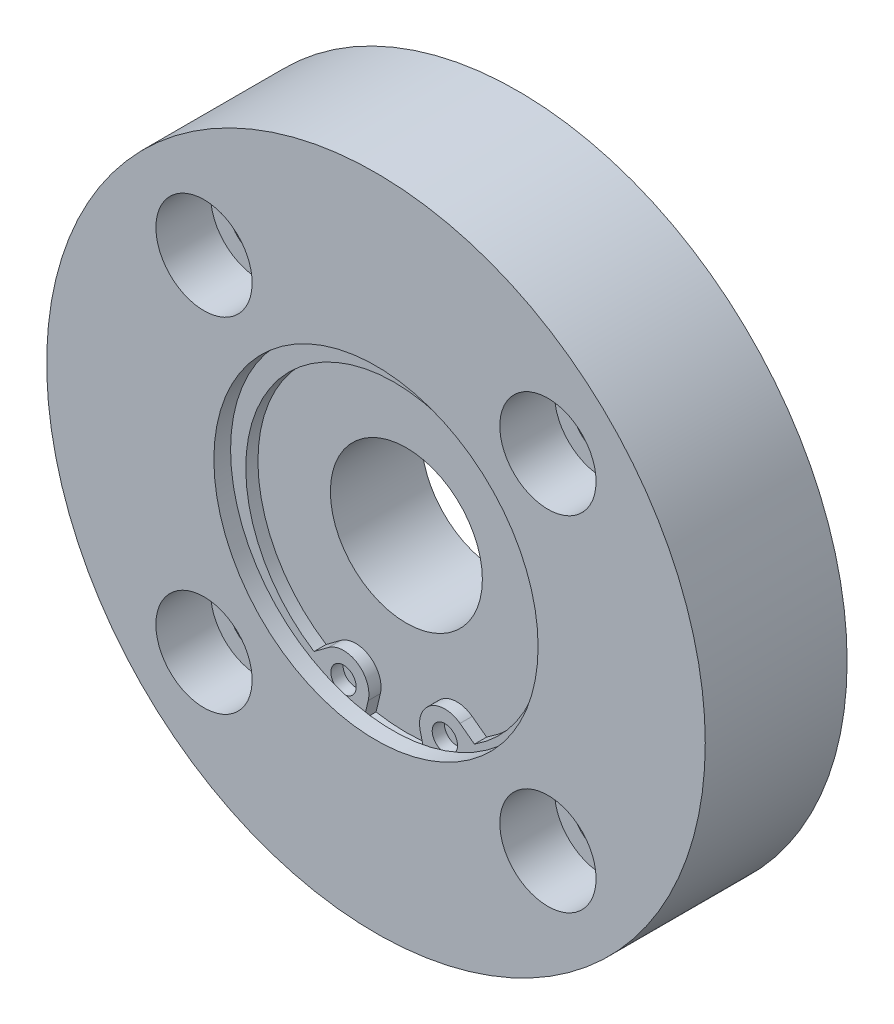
ISO-10303-21;
HEADER;
FILE_DESCRIPTION(('STEP AP214'),'2;1');
FILE_NAME('part.step','',(''),(''),'','','');
FILE_SCHEMA(('AUTOMOTIVE_DESIGN { 1 0 10303 214 1 1 1 1 }'));
ENDSEC;
DATA;
#1=APPLICATION_CONTEXT('core data for automotive mechanical design processes');
#2=APPLICATION_PROTOCOL_DEFINITION('international standard','automotive_design',2000,#1);
#3=PRODUCT_CONTEXT('',#1,'mechanical');
#4=PRODUCT('Part','Part','',(#3));
#5=PRODUCT_RELATED_PRODUCT_CATEGORY('part','',(#4));
#6=PRODUCT_DEFINITION_FORMATION('','',#4);
#7=PRODUCT_DEFINITION_CONTEXT('part definition',#1,'design');
#8=PRODUCT_DEFINITION('design','',#6,#7);
#9=PRODUCT_DEFINITION_SHAPE('','',#8);
#10=(LENGTH_UNIT() NAMED_UNIT(*) SI_UNIT(.MILLI.,.METRE.));
#11=(NAMED_UNIT(*) PLANE_ANGLE_UNIT() SI_UNIT($,.RADIAN.));
#12=(NAMED_UNIT(*) SI_UNIT($,.STERADIAN.) SOLID_ANGLE_UNIT());
#13=UNCERTAINTY_MEASURE_WITH_UNIT(LENGTH_MEASURE(1.E-05),#10,'distance_accuracy_value','');
#14=(GEOMETRIC_REPRESENTATION_CONTEXT(3) GLOBAL_UNCERTAINTY_ASSIGNED_CONTEXT((#13)) GLOBAL_UNIT_ASSIGNED_CONTEXT((#10,
#11,#12)) REPRESENTATION_CONTEXT('',''));
#15=CARTESIAN_POINT('',(0.,0.,0.));
#16=DIRECTION('',(0.,0.,1.));
#17=DIRECTION('',(1.,0.,0.));
#18=AXIS2_PLACEMENT_3D('',#15,#16,#17);
#19=CARTESIAN_POINT('',(0.,0.,11.));
#20=DIRECTION('',(0.,0.,1.));
#21=DIRECTION('',(1.,0.,0.));
#22=AXIS2_PLACEMENT_3D('',#19,#20,#21);
#23=PLANE('',#22);
#24=CARTESIAN_POINT('',(5.,-14.2233767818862,11.));
#25=DIRECTION('',(0.,0.,1.));
#26=DIRECTION('',(1.,0.,0.));
#27=AXIS2_PLACEMENT_3D('',#24,#25,#26);
#28=CIRCLE('',#27,1.25);
#29=CARTESIAN_POINT('',(6.25,-14.2233767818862,11.));
#30=VERTEX_POINT('',#29);
#31=EDGE_CURVE('E117',#30,#30,#28,.T.);
#32=ORIENTED_EDGE('',*,*,#31,.T.);
#33=EDGE_LOOP('',(#32));
#34=FACE_BOUND('',#33,.T.);
#35=ADVANCED_FACE('F14',(#34),#23,.T.);
#36=CARTESIAN_POINT('',(-5.,-14.2233767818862,11.));
#37=DIRECTION('',(0.,0.,-1.));
#38=DIRECTION('',(1.,0.,0.));
#39=AXIS2_PLACEMENT_3D('',#36,#37,#38);
#40=CIRCLE('',#39,1.25);
#41=CARTESIAN_POINT('',(-3.75,-14.2233767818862,11.));
#42=VERTEX_POINT('',#41);
#43=EDGE_CURVE('E143',#42,#42,#40,.T.);
#44=ORIENTED_EDGE('',*,*,#43,.F.);
#45=EDGE_LOOP('',(#44));
#46=FACE_BOUND('',#45,.T.);
#47=ADVANCED_FACE('F279',(#46),#23,.T.);
#48=CARTESIAN_POINT('',(16.9705627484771,16.9705627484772,8.6));
#49=DIRECTION('',(0.,0.,1.));
#50=DIRECTION('',(1.,0.,0.));
#51=AXIS2_PLACEMENT_3D('',#48,#49,#50);
#52=PLANE('',#51);
#53=CARTESIAN_POINT('',(16.9705627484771,16.9705627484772,8.6));
#54=DIRECTION('',(0.,0.,1.));
#55=DIRECTION('',(1.,0.,0.));
#56=AXIS2_PLACEMENT_3D('',#53,#54,#55);
#57=CIRCLE('',#56,4.75);
#58=CARTESIAN_POINT('',(21.7205627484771,16.9705627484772,8.6));
#59=VERTEX_POINT('',#58);
#60=EDGE_CURVE('E230',#59,#59,#57,.T.);
#61=ORIENTED_EDGE('',*,*,#60,.T.);
#62=EDGE_LOOP('',(#61));
#63=FACE_BOUND('',#62,.T.);
#64=CARTESIAN_POINT('',(16.9705627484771,16.9705627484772,8.6));
#65=DIRECTION('',(0.,0.,1.));
#66=DIRECTION('',(1.,0.,0.));
#67=AXIS2_PLACEMENT_3D('',#64,#65,#66);
#68=CIRCLE('',#67,3.);
#69=CARTESIAN_POINT('',(19.970562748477,16.9705627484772,8.6));
#70=VERTEX_POINT('',#69);
#71=EDGE_CURVE('E233',#70,#70,#68,.F.);
#72=ORIENTED_EDGE('',*,*,#71,.T.);
#73=EDGE_LOOP('',(#72));
#74=FACE_BOUND('',#73,.T.);
#75=ADVANCED_FACE('F287',(#63,#74),#52,.T.);
#76=CARTESIAN_POINT('',(16.9705627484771,-16.9705627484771,8.6));
#77=DIRECTION('',(0.,0.,1.));
#78=DIRECTION('',(0.,-1.,0.));
#79=AXIS2_PLACEMENT_3D('',#76,#77,#78);
#80=PLANE('',#79);
#81=CARTESIAN_POINT('',(16.9705627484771,-16.9705627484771,8.6));
#82=DIRECTION('',(0.,0.,1.));
#83=DIRECTION('',(0.,-1.,0.));
#84=AXIS2_PLACEMENT_3D('',#81,#82,#83);
#85=CIRCLE('',#84,4.75);
#86=CARTESIAN_POINT('',(16.9705627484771,-21.7205627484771,8.6));
#87=VERTEX_POINT('',#86);
#88=EDGE_CURVE('E214',#87,#87,#85,.T.);
#89=ORIENTED_EDGE('',*,*,#88,.T.);
#90=EDGE_LOOP('',(#89));
#91=FACE_BOUND('',#90,.T.);
#92=CARTESIAN_POINT('',(16.9705627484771,-16.9705627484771,8.6));
#93=DIRECTION('',(0.,0.,1.));
#94=DIRECTION('',(1.,0.,0.));
#95=AXIS2_PLACEMENT_3D('',#92,#93,#94);
#96=CIRCLE('',#95,3.);
#97=CARTESIAN_POINT('',(19.9705627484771,-16.9705627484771,8.6));
#98=VERTEX_POINT('',#97);
#99=EDGE_CURVE('E217',#98,#98,#96,.F.);
#100=ORIENTED_EDGE('',*,*,#99,.T.);
#101=EDGE_LOOP('',(#100));
#102=FACE_BOUND('',#101,.T.);
#103=ADVANCED_FACE('F583',(#91,#102),#80,.T.);
#104=CARTESIAN_POINT('',(-16.9705627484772,-16.9705627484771,8.6));
#105=DIRECTION('',(0.,0.,1.));
#106=DIRECTION('',(-1.,0.,0.));
#107=AXIS2_PLACEMENT_3D('',#104,#105,#106);
#108=PLANE('',#107);
#109=CARTESIAN_POINT('',(-16.9705627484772,-16.9705627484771,8.6));
#110=DIRECTION('',(0.,0.,1.));
#111=DIRECTION('',(-1.,0.,0.));
#112=AXIS2_PLACEMENT_3D('',#109,#110,#111);
#113=CIRCLE('',#112,4.75);
#114=CARTESIAN_POINT('',(-21.7205627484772,-16.9705627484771,8.6));
#115=VERTEX_POINT('',#114);
#116=EDGE_CURVE('E207',#115,#115,#113,.T.);
#117=ORIENTED_EDGE('',*,*,#116,.T.);
#118=EDGE_LOOP('',(#117));
#119=FACE_BOUND('',#118,.T.);
#120=CARTESIAN_POINT('',(-16.9705627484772,-16.9705627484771,8.6));
#121=DIRECTION('',(0.,0.,1.));
#122=DIRECTION('',(1.,0.,0.));
#123=AXIS2_PLACEMENT_3D('',#120,#121,#122);
#124=CIRCLE('',#123,3.);
#125=CARTESIAN_POINT('',(-13.9705627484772,-16.9705627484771,8.6));
#126=VERTEX_POINT('',#125);
#127=EDGE_CURVE('E210',#126,#126,#124,.F.);
#128=ORIENTED_EDGE('',*,*,#127,.T.);
#129=EDGE_LOOP('',(#128));
#130=FACE_BOUND('',#129,.T.);
#131=ADVANCED_FACE('F573',(#119,#130),#108,.T.);
#132=CARTESIAN_POINT('',(-16.9705627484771,16.9705627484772,8.6));
#133=DIRECTION('',(0.,0.,1.));
#134=DIRECTION('',(0.,1.,0.));
#135=AXIS2_PLACEMENT_3D('',#132,#133,#134);
#136=PLANE('',#135);
#137=CARTESIAN_POINT('',(-16.9705627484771,16.9705627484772,8.6));
#138=DIRECTION('',(0.,0.,1.));
#139=DIRECTION('',(0.,1.,0.));
#140=AXIS2_PLACEMENT_3D('',#137,#138,#139);
#141=CIRCLE('',#140,4.75);
#142=CARTESIAN_POINT('',(-16.970562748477,21.7205627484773,8.6));
#143=VERTEX_POINT('',#142);
#144=EDGE_CURVE('E200',#143,#143,#141,.T.);
#145=ORIENTED_EDGE('',*,*,#144,.T.);
#146=EDGE_LOOP('',(#145));
#147=FACE_BOUND('',#146,.T.);
#148=CARTESIAN_POINT('',(-16.9705627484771,16.9705627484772,8.6));
#149=DIRECTION('',(0.,0.,1.));
#150=DIRECTION('',(1.,0.,0.));
#151=AXIS2_PLACEMENT_3D('',#148,#149,#150);
#152=CIRCLE('',#151,3.);
#153=CARTESIAN_POINT('',(-13.9705627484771,16.9705627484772,8.6));
#154=VERTEX_POINT('',#153);
#155=EDGE_CURVE('E203',#154,#154,#152,.F.);
#156=ORIENTED_EDGE('',*,*,#155,.T.);
#157=EDGE_LOOP('',(#156));
#158=FACE_BOUND('',#157,.T.);
#159=ADVANCED_FACE('F563',(#147,#158),#136,.T.);
#160=CARTESIAN_POINT('',(16.9705627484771,16.9705627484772,0.));
#161=DIRECTION('',(0.,0.,1.));
#162=DIRECTION('',(1.,0.,0.));
#163=AXIS2_PLACEMENT_3D('',#160,#161,#162);
#164=CYLINDRICAL_SURFACE('',#163,3.);
#165=CARTESIAN_POINT('',(16.9705627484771,16.9705627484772,0.));
#166=DIRECTION('',(0.,0.,1.));
#167=DIRECTION('',(1.,0.,0.));
#168=AXIS2_PLACEMENT_3D('',#165,#166,#167);
#169=CIRCLE('',#168,3.);
#170=CARTESIAN_POINT('',(19.970562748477,16.9705627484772,0.));
#171=VERTEX_POINT('',#170);
#172=EDGE_CURVE('E234',#171,#171,#169,.T.);
#173=ORIENTED_EDGE('',*,*,#172,.F.);
#174=EDGE_LOOP('',(#173));
#175=FACE_BOUND('',#174,.T.);
#176=ORIENTED_EDGE('',*,*,#71,.F.);
#177=EDGE_LOOP('',(#176));
#178=FACE_BOUND('',#177,.T.);
#179=ADVANCED_FACE('F553',(#175,#178),#164,.F.);
#180=CARTESIAN_POINT('',(16.9705627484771,-16.9705627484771,0.));
#181=DIRECTION('',(0.,0.,1.));
#182=DIRECTION('',(1.,0.,0.));
#183=AXIS2_PLACEMENT_3D('',#180,#181,#182);
#184=CYLINDRICAL_SURFACE('',#183,3.);
#185=CARTESIAN_POINT('',(16.9705627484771,-16.9705627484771,0.));
#186=DIRECTION('',(0.,0.,1.));
#187=DIRECTION('',(0.,-1.,0.));
#188=AXIS2_PLACEMENT_3D('',#185,#186,#187);
#189=CIRCLE('',#188,3.);
#190=CARTESIAN_POINT('',(16.9705627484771,-19.9705627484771,0.));
#191=VERTEX_POINT('',#190);
#192=EDGE_CURVE('E224',#191,#191,#189,.T.);
#193=ORIENTED_EDGE('',*,*,#192,.F.);
#194=EDGE_LOOP('',(#193));
#195=FACE_BOUND('',#194,.T.);
#196=ORIENTED_EDGE('',*,*,#99,.F.);
#197=EDGE_LOOP('',(#196));
#198=FACE_BOUND('',#197,.T.);
#199=ADVANCED_FACE('F543',(#195,#198),#184,.F.);
#200=CARTESIAN_POINT('',(-16.9705627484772,-16.9705627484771,0.));
#201=DIRECTION('',(0.,0.,1.));
#202=DIRECTION('',(1.,0.,0.));
#203=AXIS2_PLACEMENT_3D('',#200,#201,#202);
#204=CYLINDRICAL_SURFACE('',#203,3.);
#205=CARTESIAN_POINT('',(-16.9705627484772,-16.9705627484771,0.));
#206=DIRECTION('',(0.,0.,1.));
#207=DIRECTION('',(-1.,0.,0.));
#208=AXIS2_PLACEMENT_3D('',#205,#206,#207);
#209=CIRCLE('',#208,3.);
#210=CARTESIAN_POINT('',(-19.9705627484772,-16.9705627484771,0.));
#211=VERTEX_POINT('',#210);
#212=EDGE_CURVE('E221',#211,#211,#209,.T.);
#213=ORIENTED_EDGE('',*,*,#212,.F.);
#214=EDGE_LOOP('',(#213));
#215=FACE_BOUND('',#214,.T.);
#216=ORIENTED_EDGE('',*,*,#127,.F.);
#217=EDGE_LOOP('',(#216));
#218=FACE_BOUND('',#217,.T.);
#219=ADVANCED_FACE('F533',(#215,#218),#204,.F.);
#220=CARTESIAN_POINT('',(-16.9705627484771,16.9705627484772,0.));
#221=DIRECTION('',(0.,0.,1.));
#222=DIRECTION('',(1.,0.,0.));
#223=AXIS2_PLACEMENT_3D('',#220,#221,#222);
#224=CYLINDRICAL_SURFACE('',#223,3.);
#225=CARTESIAN_POINT('',(-16.9705627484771,16.9705627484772,0.));
#226=DIRECTION('',(0.,0.,1.));
#227=DIRECTION('',(0.,1.,0.));
#228=AXIS2_PLACEMENT_3D('',#225,#226,#227);
#229=CIRCLE('',#228,3.);
#230=CARTESIAN_POINT('',(-16.970562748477,19.9705627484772,0.));
#231=VERTEX_POINT('',#230);
#232=EDGE_CURVE('E218',#231,#231,#229,.T.);
#233=ORIENTED_EDGE('',*,*,#232,.F.);
#234=EDGE_LOOP('',(#233));
#235=FACE_BOUND('',#234,.T.);
#236=ORIENTED_EDGE('',*,*,#155,.F.);
#237=EDGE_LOOP('',(#236));
#238=FACE_BOUND('',#237,.T.);
#239=ADVANCED_FACE('F524',(#235,#238),#224,.F.);
#240=CARTESIAN_POINT('',(0.,0.,14.));
#241=DIRECTION('',(0.,0.,-1.));
#242=DIRECTION('',(-1.,0.,0.));
#243=AXIS2_PLACEMENT_3D('',#240,#241,#242);
#244=CYLINDRICAL_SURFACE('',#243,32.5);
#245=CARTESIAN_POINT('',(0.,0.,14.));
#246=DIRECTION('',(0.,0.,1.));
#247=DIRECTION('',(1.,0.,0.));
#248=AXIS2_PLACEMENT_3D('',#245,#246,#247);
#249=CIRCLE('',#248,32.5);
#250=CARTESIAN_POINT('',(32.5,0.,14.));
#251=VERTEX_POINT('',#250);
#252=EDGE_CURVE('E144',#251,#251,#249,.T.);
#253=ORIENTED_EDGE('',*,*,#252,.F.);
#254=EDGE_LOOP('',(#253));
#255=FACE_BOUND('',#254,.T.);
#256=CARTESIAN_POINT('',(0.,0.,0.));
#257=DIRECTION('',(0.,0.,1.));
#258=DIRECTION('',(1.,0.,0.));
#259=AXIS2_PLACEMENT_3D('',#256,#257,#258);
#260=CIRCLE('',#259,32.5);
#261=CARTESIAN_POINT('',(32.5,0.,0.));
#262=VERTEX_POINT('',#261);
#263=EDGE_CURVE('E237',#262,#262,#260,.T.);
#264=ORIENTED_EDGE('',*,*,#263,.T.);
#265=EDGE_LOOP('',(#264));
#266=FACE_BOUND('',#265,.T.);
#267=ADVANCED_FACE('F16',(#255,#266),#244,.T.);
#268=CARTESIAN_POINT('',(16.9705627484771,16.9705627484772,8.6));
#269=DIRECTION('',(0.,0.,1.));
#270=DIRECTION('',(1.,0.,0.));
#271=AXIS2_PLACEMENT_3D('',#268,#269,#270);
#272=CYLINDRICAL_SURFACE('',#271,4.75);
#273=ORIENTED_EDGE('',*,*,#60,.F.);
#274=EDGE_LOOP('',(#273));
#275=FACE_BOUND('',#274,.T.);
#276=CARTESIAN_POINT('',(16.9705627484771,16.9705627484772,14.));
#277=DIRECTION('',(0.,0.,1.));
#278=DIRECTION('',(1.,0.,0.));
#279=AXIS2_PLACEMENT_3D('',#276,#277,#278);
#280=CIRCLE('',#279,4.75);
#281=CARTESIAN_POINT('',(21.7205627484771,16.9705627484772,14.));
#282=VERTEX_POINT('',#281);
#283=EDGE_CURVE('E227',#282,#282,#280,.T.);
#284=ORIENTED_EDGE('',*,*,#283,.T.);
#285=EDGE_LOOP('',(#284));
#286=FACE_BOUND('',#285,.T.);
#287=ADVANCED_FACE('F505',(#275,#286),#272,.F.);
#288=CARTESIAN_POINT('',(16.9705627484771,-16.9705627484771,8.6));
#289=DIRECTION('',(0.,0.,1.));
#290=DIRECTION('',(1.,0.,0.));
#291=AXIS2_PLACEMENT_3D('',#288,#289,#290);
#292=CYLINDRICAL_SURFACE('',#291,4.75);
#293=ORIENTED_EDGE('',*,*,#88,.F.);
#294=EDGE_LOOP('',(#293));
#295=FACE_BOUND('',#294,.T.);
#296=CARTESIAN_POINT('',(16.9705627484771,-16.9705627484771,14.));
#297=DIRECTION('',(0.,0.,1.));
#298=DIRECTION('',(0.,-1.,0.));
#299=AXIS2_PLACEMENT_3D('',#296,#297,#298);
#300=CIRCLE('',#299,4.75);
#301=CARTESIAN_POINT('',(16.9705627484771,-21.7205627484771,14.));
#302=VERTEX_POINT('',#301);
#303=EDGE_CURVE('E211',#302,#302,#300,.T.);
#304=ORIENTED_EDGE('',*,*,#303,.T.);
#305=EDGE_LOOP('',(#304));
#306=FACE_BOUND('',#305,.T.);
#307=ADVANCED_FACE('F495',(#295,#306),#292,.F.);
#308=CARTESIAN_POINT('',(-16.9705627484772,-16.9705627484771,8.6));
#309=DIRECTION('',(0.,0.,1.));
#310=DIRECTION('',(1.,0.,0.));
#311=AXIS2_PLACEMENT_3D('',#308,#309,#310);
#312=CYLINDRICAL_SURFACE('',#311,4.75);
#313=ORIENTED_EDGE('',*,*,#116,.F.);
#314=EDGE_LOOP('',(#313));
#315=FACE_BOUND('',#314,.T.);
#316=CARTESIAN_POINT('',(-16.9705627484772,-16.9705627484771,14.));
#317=DIRECTION('',(0.,0.,1.));
#318=DIRECTION('',(-1.,0.,0.));
#319=AXIS2_PLACEMENT_3D('',#316,#317,#318);
#320=CIRCLE('',#319,4.75);
#321=CARTESIAN_POINT('',(-21.7205627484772,-16.9705627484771,14.));
#322=VERTEX_POINT('',#321);
#323=EDGE_CURVE('E204',#322,#322,#320,.T.);
#324=ORIENTED_EDGE('',*,*,#323,.T.);
#325=EDGE_LOOP('',(#324));
#326=FACE_BOUND('',#325,.T.);
#327=ADVANCED_FACE('F485',(#315,#326),#312,.F.);
#328=CARTESIAN_POINT('',(-16.9705627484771,16.9705627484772,8.6));
#329=DIRECTION('',(0.,0.,1.));
#330=DIRECTION('',(1.,0.,0.));
#331=AXIS2_PLACEMENT_3D('',#328,#329,#330);
#332=CYLINDRICAL_SURFACE('',#331,4.75);
#333=ORIENTED_EDGE('',*,*,#144,.F.);
#334=EDGE_LOOP('',(#333));
#335=FACE_BOUND('',#334,.T.);
#336=CARTESIAN_POINT('',(-16.9705627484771,16.9705627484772,14.));
#337=DIRECTION('',(0.,0.,1.));
#338=DIRECTION('',(0.,1.,0.));
#339=AXIS2_PLACEMENT_3D('',#336,#337,#338);
#340=CIRCLE('',#339,4.75);
#341=CARTESIAN_POINT('',(-16.970562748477,21.7205627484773,14.));
#342=VERTEX_POINT('',#341);
#343=EDGE_CURVE('E197',#342,#342,#340,.T.);
#344=ORIENTED_EDGE('',*,*,#343,.T.);
#345=EDGE_LOOP('',(#344));
#346=FACE_BOUND('',#345,.T.);
#347=ADVANCED_FACE('F475',(#335,#346),#332,.F.);
#348=CARTESIAN_POINT('',(0.,0.,0.));
#349=DIRECTION('',(0.,0.,1.));
#350=DIRECTION('',(1.,0.,0.));
#351=AXIS2_PLACEMENT_3D('',#348,#349,#350);
#352=PLANE('',#351);
#353=CARTESIAN_POINT('',(0.,0.,0.));
#354=DIRECTION('',(0.,0.,-1.));
#355=DIRECTION('',(-1.,0.,0.));
#356=AXIS2_PLACEMENT_3D('',#353,#354,#355);
#357=CIRCLE('',#356,14.);
#358=CARTESIAN_POINT('',(-14.,0.,0.));
#359=VERTEX_POINT('',#358);
#360=EDGE_CURVE('E186',#359,#359,#357,.T.);
#361=ORIENTED_EDGE('',*,*,#360,.F.);
#362=EDGE_LOOP('',(#361));
#363=FACE_BOUND('',#362,.T.);
#364=ORIENTED_EDGE('',*,*,#232,.T.);
#365=EDGE_LOOP('',(#364));
#366=FACE_BOUND('',#365,.T.);
#367=ORIENTED_EDGE('',*,*,#212,.T.);
#368=EDGE_LOOP('',(#367));
#369=FACE_BOUND('',#368,.T.);
#370=ORIENTED_EDGE('',*,*,#192,.T.);
#371=EDGE_LOOP('',(#370));
#372=FACE_BOUND('',#371,.T.);
#373=ORIENTED_EDGE('',*,*,#172,.T.);
#374=EDGE_LOOP('',(#373));
#375=FACE_BOUND('',#374,.T.);
#376=ORIENTED_EDGE('',*,*,#263,.F.);
#377=EDGE_LOOP('',(#376));
#378=FACE_BOUND('',#377,.T.);
#379=ADVANCED_FACE('F466',(#363,#366,#369,#372,#375,#378),#352,.F.);
#380=CARTESIAN_POINT('',(0.,0.,14.));
#381=DIRECTION('',(0.,0.,1.));
#382=DIRECTION('',(1.,0.,0.));
#383=AXIS2_PLACEMENT_3D('',#380,#381,#382);
#384=PLANE('',#383);
#385=CARTESIAN_POINT('',(0.,0.,14.));
#386=DIRECTION('',(0.,0.,1.));
#387=DIRECTION('',(1.,0.,0.));
#388=AXIS2_PLACEMENT_3D('',#385,#386,#387);
#389=CIRCLE('',#388,16.);
#390=CARTESIAN_POINT('',(16.,0.,14.));
#391=VERTEX_POINT('',#390);
#392=EDGE_CURVE('E193',#391,#391,#389,.T.);
#393=ORIENTED_EDGE('',*,*,#392,.F.);
#394=EDGE_LOOP('',(#393));
#395=FACE_BOUND('',#394,.T.);
#396=ORIENTED_EDGE('',*,*,#343,.F.);
#397=EDGE_LOOP('',(#396));
#398=FACE_BOUND('',#397,.T.);
#399=ORIENTED_EDGE('',*,*,#323,.F.);
#400=EDGE_LOOP('',(#399));
#401=FACE_BOUND('',#400,.T.);
#402=ORIENTED_EDGE('',*,*,#303,.F.);
#403=EDGE_LOOP('',(#402));
#404=FACE_BOUND('',#403,.T.);
#405=ORIENTED_EDGE('',*,*,#283,.F.);
#406=EDGE_LOOP('',(#405));
#407=FACE_BOUND('',#406,.T.);
#408=ORIENTED_EDGE('',*,*,#252,.T.);
#409=EDGE_LOOP('',(#408));
#410=FACE_BOUND('',#409,.T.);
#411=ADVANCED_FACE('F457',(#395,#398,#401,#404,#407,#410),#384,.T.);
#412=CARTESIAN_POINT('',(0.,0.,2.));
#413=DIRECTION('',(0.,0.,-1.));
#414=DIRECTION('',(-1.,0.,0.));
#415=AXIS2_PLACEMENT_3D('',#412,#413,#414);
#416=CYLINDRICAL_SURFACE('',#415,14.);
#417=CARTESIAN_POINT('',(0.,0.,2.));
#418=DIRECTION('',(0.,0.,-1.));
#419=DIRECTION('',(-1.,0.,0.));
#420=AXIS2_PLACEMENT_3D('',#417,#418,#419);
#421=CIRCLE('',#420,14.);
#422=CARTESIAN_POINT('',(-14.,0.,2.));
#423=VERTEX_POINT('',#422);
#424=EDGE_CURVE('E189',#423,#423,#421,.T.);
#425=ORIENTED_EDGE('',*,*,#424,.F.);
#426=EDGE_LOOP('',(#425));
#427=FACE_BOUND('',#426,.T.);
#428=ORIENTED_EDGE('',*,*,#360,.T.);
#429=EDGE_LOOP('',(#428));
#430=FACE_BOUND('',#429,.T.);
#431=ADVANCED_FACE('F449',(#427,#430),#416,.F.);
#432=CARTESIAN_POINT('',(0.,0.,11.));
#433=DIRECTION('',(0.,0.,1.));
#434=DIRECTION('',(1.,0.,0.));
#435=AXIS2_PLACEMENT_3D('',#432,#433,#434);
#436=CYLINDRICAL_SURFACE('',#435,16.);
#437=CARTESIAN_POINT('',(0.,0.,12.35));
#438=DIRECTION('',(0.,0.,1.));
#439=DIRECTION('',(1.,0.,0.));
#440=AXIS2_PLACEMENT_3D('',#437,#438,#439);
#441=CIRCLE('',#440,16.);
#442=CARTESIAN_POINT('',(16.,0.,12.35));
#443=VERTEX_POINT('',#442);
#444=EDGE_CURVE('E182',#443,#443,#441,.F.);
#445=ORIENTED_EDGE('',*,*,#444,.T.);
#446=EDGE_LOOP('',(#445));
#447=FACE_BOUND('',#446,.T.);
#448=ORIENTED_EDGE('',*,*,#392,.T.);
#449=EDGE_LOOP('',(#448));
#450=FACE_BOUND('',#449,.T.);
#451=ADVANCED_FACE('F257',(#447,#450),#436,.F.);
#452=CARTESIAN_POINT('',(0.,0.,2.));
#453=DIRECTION('',(0.,0.,-1.));
#454=DIRECTION('',(-1.,0.,0.));
#455=AXIS2_PLACEMENT_3D('',#452,#453,#454);
#456=PLANE('',#455);
#457=CARTESIAN_POINT('',(0.,0.,2.));
#458=DIRECTION('',(0.,0.,-1.));
#459=DIRECTION('',(-1.,0.,0.));
#460=AXIS2_PLACEMENT_3D('',#457,#458,#459);
#461=CIRCLE('',#460,7.5);
#462=CARTESIAN_POINT('',(-7.5,0.,2.));
#463=VERTEX_POINT('',#462);
#464=EDGE_CURVE('E192',#463,#463,#461,.T.);
#465=ORIENTED_EDGE('',*,*,#464,.F.);
#466=EDGE_LOOP('',(#465));
#467=FACE_BOUND('',#466,.T.);
#468=ORIENTED_EDGE('',*,*,#424,.T.);
#469=EDGE_LOOP('',(#468));
#470=FACE_BOUND('',#469,.T.);
#471=ADVANCED_FACE('F263',(#467,#470),#456,.T.);
#472=CARTESIAN_POINT('',(0.,0.,12.35));
#473=DIRECTION('',(0.,0.,1.));
#474=DIRECTION('',(1.,0.,0.));
#475=AXIS2_PLACEMENT_3D('',#472,#473,#474);
#476=PLANE('',#475);
#477=CARTESIAN_POINT('',(0.,0.,12.35));
#478=DIRECTION('',(0.,0.,1.));
#479=DIRECTION('',(1.,0.,0.));
#480=AXIS2_PLACEMENT_3D('',#477,#478,#479);
#481=CIRCLE('',#480,16.85);
#482=CARTESIAN_POINT('',(16.85,0.,12.35));
#483=VERTEX_POINT('',#482);
#484=EDGE_CURVE('E179',#483,#483,#481,.T.);
#485=ORIENTED_EDGE('',*,*,#484,.F.);
#486=EDGE_LOOP('',(#485));
#487=FACE_BOUND('',#486,.T.);
#488=ORIENTED_EDGE('',*,*,#444,.F.);
#489=EDGE_LOOP('',(#488));
#490=FACE_BOUND('',#489,.T.);
#491=ADVANCED_FACE('F260',(#487,#490),#476,.F.);
#492=CARTESIAN_POINT('',(0.,0.,12.35));
#493=DIRECTION('',(0.,0.,-1.));
#494=DIRECTION('',(-1.,0.,0.));
#495=AXIS2_PLACEMENT_3D('',#492,#493,#494);
#496=CYLINDRICAL_SURFACE('',#495,16.85);
#497=ORIENTED_EDGE('',*,*,#484,.T.);
#498=EDGE_LOOP('',(#497));
#499=FACE_BOUND('',#498,.T.);
#500=DIRECTION('',(0.,0.,-1.));
#501=VECTOR('',#500,1.);
#502=CARTESIAN_POINT('',(2.99125499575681,-16.5823669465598,12.35));
#503=LINE('',#502,#501);
#504=CARTESIAN_POINT('',(2.99125499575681,-16.5823669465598,11.));
#505=VERTEX_POINT('',#504);
#506=CARTESIAN_POINT('',(2.99125499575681,-16.5823669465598,12.2));
#507=VERTEX_POINT('',#506);
#508=EDGE_CURVE('E18',#505,#507,#503,.F.);
#509=ORIENTED_EDGE('',*,*,#508,.F.);
#510=CARTESIAN_POINT('',(0.,0.,11.));
#511=DIRECTION('',(0.,0.,1.));
#512=DIRECTION('',(1.,0.,0.));
#513=AXIS2_PLACEMENT_3D('',#510,#511,#512);
#514=CIRCLE('',#513,16.85);
#515=CARTESIAN_POINT('',(-2.99125499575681,-16.5823669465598,11.));
#516=VERTEX_POINT('',#515);
#517=EDGE_CURVE('E183',#516,#505,#514,.T.);
#518=ORIENTED_EDGE('',*,*,#517,.F.);
#519=DIRECTION('',(0.,0.,-1.));
#520=VECTOR('',#519,1.);
#521=CARTESIAN_POINT('',(-2.99125499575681,-16.5823669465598,12.35));
#522=LINE('',#521,#520);
#523=CARTESIAN_POINT('',(-2.99125499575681,-16.5823669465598,12.2));
#524=VERTEX_POINT('',#523);
#525=EDGE_CURVE('E176',#524,#516,#522,.T.);
#526=ORIENTED_EDGE('',*,*,#525,.F.);
#527=CARTESIAN_POINT('',(0.,0.,12.2));
#528=DIRECTION('',(0.,0.,-1.));
#529=DIRECTION('',(-1.,0.,0.));
#530=AXIS2_PLACEMENT_3D('',#527,#528,#529);
#531=CIRCLE('',#530,16.85);
#532=EDGE_CURVE('E9',#507,#524,#531,.F.);
#533=ORIENTED_EDGE('',*,*,#532,.F.);
#534=EDGE_LOOP('',(#509,#518,#526,#533));
#535=FACE_BOUND('',#534,.T.);
#536=ADVANCED_FACE('F262',(#499,#535),#496,.F.);
#537=CARTESIAN_POINT('',(0.,0.,14.));
#538=DIRECTION('',(0.,0.,-1.));
#539=DIRECTION('',(-1.,0.,0.));
#540=AXIS2_PLACEMENT_3D('',#537,#538,#539);
#541=CYLINDRICAL_SURFACE('',#540,7.5);
#542=CARTESIAN_POINT('',(0.,0.,11.));
#543=DIRECTION('',(0.,0.,1.));
#544=DIRECTION('',(1.,0.,0.));
#545=AXIS2_PLACEMENT_3D('',#542,#543,#544);
#546=CIRCLE('',#545,7.5);
#547=CARTESIAN_POINT('',(7.5,0.,11.));
#548=VERTEX_POINT('',#547);
#549=EDGE_CURVE('E196',#548,#548,#546,.T.);
#550=ORIENTED_EDGE('',*,*,#549,.T.);
#551=EDGE_LOOP('',(#550));
#552=FACE_BOUND('',#551,.T.);
#553=ORIENTED_EDGE('',*,*,#464,.T.);
#554=EDGE_LOOP('',(#553));
#555=FACE_BOUND('',#554,.T.);
#556=ADVANCED_FACE('F271',(#552,#555),#541,.F.);
#557=ORIENTED_EDGE('',*,*,#549,.F.);
#558=EDGE_LOOP('',(#557));
#559=FACE_BOUND('',#558,.T.);
#560=DIRECTION('',(0.231349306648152,-0.972870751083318,0.));
#561=VECTOR('',#560,1.);
#562=CARTESIAN_POINT('',(2.5678231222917,-14.8017500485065,11.));
#563=LINE('',#562,#561);
#564=CARTESIAN_POINT('',(2.5678231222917,-14.8017500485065,11.));
#565=VERTEX_POINT('',#564);
#566=EDGE_CURVE('E34',#565,#505,#563,.T.);
#567=ORIENTED_EDGE('',*,*,#566,.F.);
#568=CARTESIAN_POINT('',(5.,-14.2233767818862,11.));
#569=DIRECTION('',(0.,0.,1.));
#570=DIRECTION('',(1.,0.,0.));
#571=AXIS2_PLACEMENT_3D('',#568,#569,#570);
#572=CIRCLE('',#571,2.5);
#573=CARTESIAN_POINT('',(6.49138441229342,-12.2169439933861,11.));
#574=VERTEX_POINT('',#573);
#575=EDGE_CURVE('E134',#574,#565,#572,.T.);
#576=ORIENTED_EDGE('',*,*,#575,.F.);
#577=DIRECTION('',(-0.802573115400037,0.596553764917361,0.));
#578=VECTOR('',#577,1.);
#579=CARTESIAN_POINT('',(6.49138441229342,-12.2169439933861,11.));
#580=LINE('',#579,#578);
#581=CARTESIAN_POINT('',(7.91695293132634,-13.2765711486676,11.));
#582=VERTEX_POINT('',#581);
#583=EDGE_CURVE('E148',#582,#574,#580,.T.);
#584=ORIENTED_EDGE('',*,*,#583,.F.);
#585=CARTESIAN_POINT('',(0.,-0.95,11.));
#586=DIRECTION('',(0.,0.,-1.));
#587=DIRECTION('',(0.,-1.,0.));
#588=AXIS2_PLACEMENT_3D('',#585,#586,#587);
#589=CIRCLE('',#588,14.65);
#590=CARTESIAN_POINT('',(-7.91695293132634,-13.2765711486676,11.));
#591=VERTEX_POINT('',#590);
#592=EDGE_CURVE('E163',#591,#582,#589,.T.);
#593=ORIENTED_EDGE('',*,*,#592,.F.);
#594=DIRECTION('',(-0.802573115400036,-0.596553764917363,0.));
#595=VECTOR('',#594,1.);
#596=CARTESIAN_POINT('',(-6.49138441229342,-12.2169439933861,11.));
#597=LINE('',#596,#595);
#598=CARTESIAN_POINT('',(-6.49138441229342,-12.2169439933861,11.));
#599=VERTEX_POINT('',#598);
#600=EDGE_CURVE('E116',#599,#591,#597,.T.);
#601=ORIENTED_EDGE('',*,*,#600,.F.);
#602=CARTESIAN_POINT('',(-5.,-14.2233767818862,11.));
#603=DIRECTION('',(0.,0.,1.));
#604=DIRECTION('',(-1.,0.,0.));
#605=AXIS2_PLACEMENT_3D('',#602,#603,#604);
#606=CIRCLE('',#605,2.5);
#607=CARTESIAN_POINT('',(-2.56782312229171,-14.8017500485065,11.));
#608=VERTEX_POINT('',#607);
#609=EDGE_CURVE('E113',#608,#599,#606,.T.);
#610=ORIENTED_EDGE('',*,*,#609,.F.);
#611=DIRECTION('',(0.231349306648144,0.97287075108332,0.));
#612=VECTOR('',#611,1.);
#613=CARTESIAN_POINT('',(-2.56782312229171,-14.8017500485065,11.));
#614=LINE('',#613,#612);
#615=EDGE_CURVE('E155',#516,#608,#614,.T.);
#616=ORIENTED_EDGE('',*,*,#615,.F.);
#617=ORIENTED_EDGE('',*,*,#517,.T.);
#618=EDGE_LOOP('',(#567,#576,#584,#593,#601,#610,#616,#617));
#619=FACE_BOUND('',#618,.T.);
#620=ADVANCED_FACE('F282',(#559,#619),#23,.T.);
#621=CARTESIAN_POINT('',(0.,-0.95,12.2));
#622=DIRECTION('',(0.,0.,1.));
#623=DIRECTION('',(-1.,0.,0.));
#624=AXIS2_PLACEMENT_3D('',#621,#622,#623);
#625=CYLINDRICAL_SURFACE('',#624,14.65);
#626=ORIENTED_EDGE('',*,*,#592,.T.);
#627=DIRECTION('',(0.,0.,-1.));
#628=VECTOR('',#627,1.);
#629=CARTESIAN_POINT('',(7.91695293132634,-13.2765711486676,12.2));
#630=LINE('',#629,#628);
#631=CARTESIAN_POINT('',(7.91695293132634,-13.2765711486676,12.2));
#632=VERTEX_POINT('',#631);
#633=EDGE_CURVE('E103',#632,#582,#630,.T.);
#634=ORIENTED_EDGE('',*,*,#633,.F.);
#635=CARTESIAN_POINT('',(0.,-0.95,12.2));
#636=DIRECTION('',(0.,0.,-1.));
#637=DIRECTION('',(0.,-1.,0.));
#638=AXIS2_PLACEMENT_3D('',#635,#636,#637);
#639=CIRCLE('',#638,14.65);
#640=CARTESIAN_POINT('',(-7.91695293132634,-13.2765711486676,12.2));
#641=VERTEX_POINT('',#640);
#642=EDGE_CURVE('E104',#641,#632,#639,.T.);
#643=ORIENTED_EDGE('',*,*,#642,.F.);
#644=DIRECTION('',(0.,0.,-1.));
#645=VECTOR('',#644,1.);
#646=CARTESIAN_POINT('',(-7.91695293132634,-13.2765711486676,12.2));
#647=LINE('',#646,#645);
#648=EDGE_CURVE('E98',#641,#591,#647,.T.);
#649=ORIENTED_EDGE('',*,*,#648,.T.);
#650=EDGE_LOOP('',(#626,#634,#643,#649));
#651=FACE_BOUND('',#650,.T.);
#652=ADVANCED_FACE('F283',(#651),#625,.F.);
#653=CARTESIAN_POINT('',(6.49138441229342,-12.2169439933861,12.2));
#654=DIRECTION('',(-0.596553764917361,-0.802573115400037,0.));
#655=DIRECTION('',(-0.802573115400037,0.596553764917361,0.));
#656=AXIS2_PLACEMENT_3D('',#653,#654,#655);
#657=PLANE('',#656);
#658=ORIENTED_EDGE('',*,*,#583,.T.);
#659=DIRECTION('',(0.,0.,-1.));
#660=VECTOR('',#659,1.);
#661=CARTESIAN_POINT('',(6.49138441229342,-12.2169439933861,12.2));
#662=LINE('',#661,#660);
#663=CARTESIAN_POINT('',(6.49138441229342,-12.2169439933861,12.2));
#664=VERTEX_POINT('',#663);
#665=EDGE_CURVE('E153',#664,#574,#662,.T.);
#666=ORIENTED_EDGE('',*,*,#665,.F.);
#667=DIRECTION('',(-0.802573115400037,0.596553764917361,0.));
#668=VECTOR('',#667,1.);
#669=CARTESIAN_POINT('',(6.49138441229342,-12.2169439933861,12.2));
#670=LINE('',#669,#668);
#671=EDGE_CURVE('E138',#632,#664,#670,.T.);
#672=ORIENTED_EDGE('',*,*,#671,.F.);
#673=ORIENTED_EDGE('',*,*,#633,.T.);
#674=EDGE_LOOP('',(#658,#666,#672,#673));
#675=FACE_BOUND('',#674,.T.);
#676=ADVANCED_FACE('F295',(#675),#657,.F.);
#677=CARTESIAN_POINT('',(5.,-14.2233767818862,12.2));
#678=DIRECTION('',(0.,0.,1.));
#679=DIRECTION('',(-1.,0.,0.));
#680=AXIS2_PLACEMENT_3D('',#677,#678,#679);
#681=CYLINDRICAL_SURFACE('',#680,2.5);
#682=ORIENTED_EDGE('',*,*,#575,.T.);
#683=DIRECTION('',(0.,0.,-1.));
#684=VECTOR('',#683,1.);
#685=CARTESIAN_POINT('',(2.5678231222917,-14.8017500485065,12.2));
#686=LINE('',#685,#684);
#687=CARTESIAN_POINT('',(2.5678231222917,-14.8017500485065,12.2));
#688=VERTEX_POINT('',#687);
#689=EDGE_CURVE('E154',#688,#565,#686,.T.);
#690=ORIENTED_EDGE('',*,*,#689,.F.);
#691=CARTESIAN_POINT('',(5.,-14.2233767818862,12.2));
#692=DIRECTION('',(0.,0.,1.));
#693=DIRECTION('',(1.,0.,0.));
#694=AXIS2_PLACEMENT_3D('',#691,#692,#693);
#695=CIRCLE('',#694,2.5);
#696=EDGE_CURVE('E167',#664,#688,#695,.T.);
#697=ORIENTED_EDGE('',*,*,#696,.F.);
#698=ORIENTED_EDGE('',*,*,#665,.T.);
#699=EDGE_LOOP('',(#682,#690,#697,#698));
#700=FACE_BOUND('',#699,.T.);
#701=ADVANCED_FACE('F301',(#700),#681,.T.);
#702=CARTESIAN_POINT('',(-2.56782312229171,-14.8017500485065,12.2));
#703=DIRECTION('',(-0.97287075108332,0.231349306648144,0.));
#704=DIRECTION('',(0.,0.,1.));
#705=AXIS2_PLACEMENT_3D('',#702,#703,#704);
#706=PLANE('',#705);
#707=DIRECTION('',(0.231349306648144,0.97287075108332,0.));
#708=VECTOR('',#707,1.);
#709=CARTESIAN_POINT('',(-2.56782312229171,-14.8017500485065,12.2));
#710=LINE('',#709,#708);
#711=CARTESIAN_POINT('',(-2.56782312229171,-14.8017500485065,12.2));
#712=VERTEX_POINT('',#711);
#713=EDGE_CURVE('E122',#524,#712,#710,.T.);
#714=ORIENTED_EDGE('',*,*,#713,.F.);
#715=ORIENTED_EDGE('',*,*,#525,.T.);
#716=ORIENTED_EDGE('',*,*,#615,.T.);
#717=DIRECTION('',(0.,0.,-1.));
#718=VECTOR('',#717,1.);
#719=CARTESIAN_POINT('',(-2.56782312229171,-14.8017500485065,12.2));
#720=LINE('',#719,#718);
#721=EDGE_CURVE('E172',#712,#608,#720,.T.);
#722=ORIENTED_EDGE('',*,*,#721,.F.);
#723=EDGE_LOOP('',(#714,#715,#716,#722));
#724=FACE_BOUND('',#723,.T.);
#725=ADVANCED_FACE('F307',(#724),#706,.F.);
#726=CARTESIAN_POINT('',(0.,-0.95,12.2));
#727=DIRECTION('',(0.,0.,-1.));
#728=DIRECTION('',(0.,-1.,0.));
#729=AXIS2_PLACEMENT_3D('',#726,#727,#728);
#730=PLANE('',#729);
#731=CARTESIAN_POINT('',(-5.,-14.2233767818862,12.2));
#732=DIRECTION('',(0.,0.,-1.));
#733=DIRECTION('',(1.,0.,0.));
#734=AXIS2_PLACEMENT_3D('',#731,#732,#733);
#735=CIRCLE('',#734,1.25);
#736=CARTESIAN_POINT('',(-3.75,-14.2233767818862,12.2));
#737=VERTEX_POINT('',#736);
#738=EDGE_CURVE('E124',#737,#737,#735,.T.);
#739=ORIENTED_EDGE('',*,*,#738,.T.);
#740=EDGE_LOOP('',(#739));
#741=FACE_BOUND('',#740,.T.);
#742=CARTESIAN_POINT('',(5.,-14.2233767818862,12.2));
#743=DIRECTION('',(0.,0.,1.));
#744=DIRECTION('',(1.,0.,0.));
#745=AXIS2_PLACEMENT_3D('',#742,#743,#744);
#746=CIRCLE('',#745,1.25);
#747=CARTESIAN_POINT('',(6.25,-14.2233767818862,12.2));
#748=VERTEX_POINT('',#747);
#749=EDGE_CURVE('E140',#748,#748,#746,.T.);
#750=ORIENTED_EDGE('',*,*,#749,.F.);
#751=EDGE_LOOP('',(#750));
#752=FACE_BOUND('',#751,.T.);
#753=DIRECTION('',(0.231349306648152,-0.972870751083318,0.));
#754=VECTOR('',#753,1.);
#755=CARTESIAN_POINT('',(2.5678231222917,-14.8017500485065,12.2));
#756=LINE('',#755,#754);
#757=EDGE_CURVE('E130',#688,#507,#756,.T.);
#758=ORIENTED_EDGE('',*,*,#757,.T.);
#759=ORIENTED_EDGE('',*,*,#532,.T.);
#760=ORIENTED_EDGE('',*,*,#713,.T.);
#761=CARTESIAN_POINT('',(-5.,-14.2233767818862,12.2));
#762=DIRECTION('',(0.,0.,1.));
#763=DIRECTION('',(-1.,0.,0.));
#764=AXIS2_PLACEMENT_3D('',#761,#762,#763);
#765=CIRCLE('',#764,2.5);
#766=CARTESIAN_POINT('',(-6.49138441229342,-12.2169439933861,12.2));
#767=VERTEX_POINT('',#766);
#768=EDGE_CURVE('E110',#712,#767,#765,.T.);
#769=ORIENTED_EDGE('',*,*,#768,.T.);
#770=DIRECTION('',(-0.802573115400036,-0.596553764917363,0.));
#771=VECTOR('',#770,1.);
#772=CARTESIAN_POINT('',(-6.49138441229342,-12.2169439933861,12.2));
#773=LINE('',#772,#771);
#774=EDGE_CURVE('E93',#767,#641,#773,.T.);
#775=ORIENTED_EDGE('',*,*,#774,.T.);
#776=ORIENTED_EDGE('',*,*,#642,.T.);
#777=ORIENTED_EDGE('',*,*,#671,.T.);
#778=ORIENTED_EDGE('',*,*,#696,.T.);
#779=EDGE_LOOP('',(#758,#759,#760,#769,#775,#776,#777,#778));
#780=FACE_BOUND('',#779,.T.);
#781=ADVANCED_FACE('F120',(#741,#752,#780),#730,.F.);
#782=CARTESIAN_POINT('',(5.,-14.2233767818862,12.2));
#783=DIRECTION('',(0.,0.,1.));
#784=DIRECTION('',(-1.,0.,0.));
#785=AXIS2_PLACEMENT_3D('',#782,#783,#784);
#786=CYLINDRICAL_SURFACE('',#785,1.25);
#787=ORIENTED_EDGE('',*,*,#31,.F.);
#788=EDGE_LOOP('',(#787));
#789=FACE_BOUND('',#788,.T.);
#790=ORIENTED_EDGE('',*,*,#749,.T.);
#791=EDGE_LOOP('',(#790));
#792=FACE_BOUND('',#791,.T.);
#793=ADVANCED_FACE('F360',(#789,#792),#786,.F.);
#794=CARTESIAN_POINT('',(-5.,-14.2233767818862,12.2));
#795=DIRECTION('',(0.,0.,1.));
#796=DIRECTION('',(-1.,0.,0.));
#797=AXIS2_PLACEMENT_3D('',#794,#795,#796);
#798=CYLINDRICAL_SURFACE('',#797,1.25);
#799=ORIENTED_EDGE('',*,*,#43,.T.);
#800=EDGE_LOOP('',(#799));
#801=FACE_BOUND('',#800,.T.);
#802=ORIENTED_EDGE('',*,*,#738,.F.);
#803=EDGE_LOOP('',(#802));
#804=FACE_BOUND('',#803,.T.);
#805=ADVANCED_FACE('F357',(#801,#804),#798,.F.);
#806=CARTESIAN_POINT('',(-6.49138441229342,-12.2169439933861,12.2));
#807=DIRECTION('',(0.596553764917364,-0.802573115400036,0.));
#808=DIRECTION('',(0.,0.,-1.));
#809=AXIS2_PLACEMENT_3D('',#806,#807,#808);
#810=PLANE('',#809);
#811=ORIENTED_EDGE('',*,*,#600,.T.);
#812=ORIENTED_EDGE('',*,*,#648,.F.);
#813=ORIENTED_EDGE('',*,*,#774,.F.);
#814=DIRECTION('',(0.,0.,-1.));
#815=VECTOR('',#814,1.);
#816=CARTESIAN_POINT('',(-6.49138441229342,-12.2169439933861,12.2));
#817=LINE('',#816,#815);
#818=EDGE_CURVE('E96',#767,#599,#817,.T.);
#819=ORIENTED_EDGE('',*,*,#818,.T.);
#820=EDGE_LOOP('',(#811,#812,#813,#819));
#821=FACE_BOUND('',#820,.T.);
#822=ADVANCED_FACE('F95',(#821),#810,.F.);
#823=CARTESIAN_POINT('',(-5.,-14.2233767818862,12.2));
#824=DIRECTION('',(0.,0.,1.));
#825=DIRECTION('',(-1.,0.,0.));
#826=AXIS2_PLACEMENT_3D('',#823,#824,#825);
#827=CYLINDRICAL_SURFACE('',#826,2.5);
#828=ORIENTED_EDGE('',*,*,#609,.T.);
#829=ORIENTED_EDGE('',*,*,#818,.F.);
#830=ORIENTED_EDGE('',*,*,#768,.F.);
#831=ORIENTED_EDGE('',*,*,#721,.T.);
#832=EDGE_LOOP('',(#828,#829,#830,#831));
#833=FACE_BOUND('',#832,.T.);
#834=ADVANCED_FACE('F108',(#833),#827,.T.);
#835=CARTESIAN_POINT('',(2.5678231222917,-14.8017500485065,12.2));
#836=DIRECTION('',(0.972870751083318,0.231349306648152,0.));
#837=DIRECTION('',(0.,0.,-1.));
#838=AXIS2_PLACEMENT_3D('',#835,#836,#837);
#839=PLANE('',#838);
#840=ORIENTED_EDGE('',*,*,#566,.T.);
#841=ORIENTED_EDGE('',*,*,#508,.T.);
#842=ORIENTED_EDGE('',*,*,#757,.F.);
#843=ORIENTED_EDGE('',*,*,#689,.T.);
#844=EDGE_LOOP('',(#840,#841,#842,#843));
#845=FACE_BOUND('',#844,.T.);
#846=ADVANCED_FACE('F289',(#845),#839,.F.);
#847=CLOSED_SHELL('',(#35,#47,#75,#103,#131,#159,#179,#199,#219,#239,#267,#287,#307,#327,#347,
#379,#411,#431,#451,#471,#491,#536,#556,#620,#652,#676,#701,#725,#781,#793,#805,#822,#834,#846));
#848=MANIFOLD_SOLID_BREP('B1',#847);
#849=ADVANCED_BREP_SHAPE_REPRESENTATION('',(#18,#848),#14);
#850=SHAPE_DEFINITION_REPRESENTATION(#9,#849);
ENDSEC;
END-ISO-10303-21;
